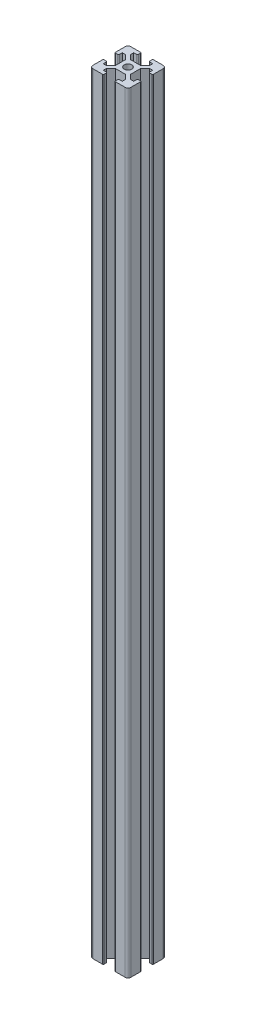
from build123d import *

# Parameters (mm, degrees)
CROQUIS1_R              = 2
SALIENTE_EXTRUIR1_DEPTH = 405
REDONDEO1_R             = 1.5
REDONDEO2_R             = 0.5


with BuildPart() as part:
    # Croquis1 → Saliente-Extruir1 (new body)
    with BuildSketch(Plane(origin=(0, 0, 0), x_dir=(1, 0, 0), z_dir=(0, 1, 0))):
        Polygon((-10, 10), (-3, 10), (-3, 8), (-5, 8), (-5, 6.414213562), (-2.585786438, 4), (2.585786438, 4), (5, 6.414213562), (5, 8), (3, 8), (3, 10), (10, 10), (10, 3), (8, 3), (8, 5), (6.414213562, 5), (4, 2.585786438), (4, -2.585786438), (6.414213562, -5), (8, -5), (8, -3), (10, -3), (10, -10), (3, -10), (3, -8), (5, -8), (5, -6.414213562), (2.585786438, -4), (-2.585786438, -4), (-5, -6.414213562), (-5, -8), (-3, -8), (-3, -10), (-10, -10), (-10, -3), (-8, -3), (-8, -5), (-6.414213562, -5), (-4, -2.585786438), (-4, 2.585786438), (-6.414213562, 5), (-8, 5), (-8, 3), (-10, 3), align=None)
        with Locations(Location((0, 0, 0), (0, 0, 270))):
            Circle(CROQUIS1_R, mode=Mode.SUBTRACT)
    extrude(amount=SALIENTE_EXTRUIR1_DEPTH)

    # Redondeo1
    redondeo1_edges = [part.edges().sort_by_distance(p)[0] for p in [
        (10, 202.5, 10),
        (-10, 202.5, 10),
        (-10, 202.5, -10),
        (10, 202.5, -10),
    ]]
    fillet(redondeo1_edges, radius=REDONDEO1_R)

    # Redondeo2
    redondeo2_edges = [part.edges().sort_by_distance(p)[0] for p in [
        (10, 202.5, -3),
        (8, 202.5, -3),
        (8, 202.5, 3),
        (10, 202.5, 3),
        (3, 202.5, 10),
        (3, 202.5, 8),
        (-3, 202.5, 8),
        (-3, 202.5, 10),
        (-10, 202.5, 3),
        (-8, 202.5, 3),
        (-8, 202.5, -3),
        (-10, 202.5, -3),
        (-3, 202.5, -10),
        (-3, 202.5, -8),
        (3, 202.5, -8),
        (3, 202.5, -10),
    ]]
    fillet(redondeo2_edges, radius=REDONDEO2_R)


solid = part.part
